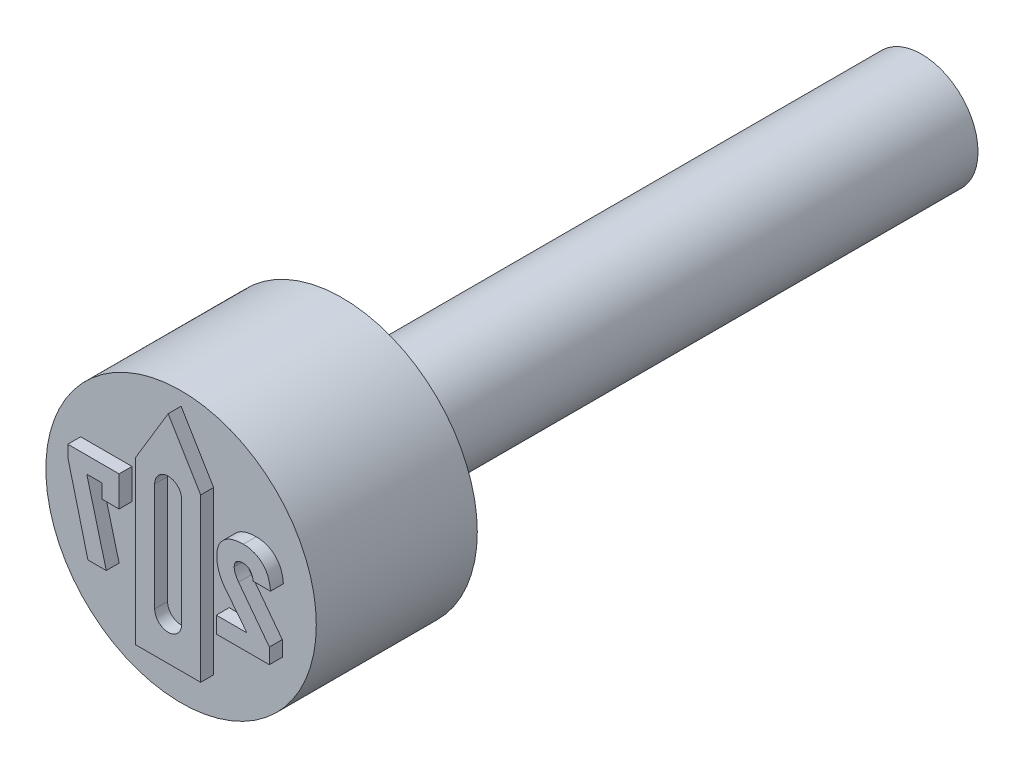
from build123d import *

# Parameters (mm, degrees)
BOSS_EXTRUDE1_DEPTH = 0.4
CUT_EXTRUDE1_DEPTH  = 0.4


with BuildPart() as part:
    # Sketch2 → Revolve1 (revolve)
    with BuildSketch(Plane(origin=(0, 0, 0), x_dir=(0, 0, -1), z_dir=(1, 0, 0)), mode=Mode.PRIVATE) as revolve1_sk:
        Polygon((0, 4.2), (0, 0), (23, 0), (23, 1.75), (5, 1.75), (5, 4.2), align=None)
    revolve(revolve1_sk.sketch.rotate(Axis((0, 0, -0.403888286), (0, 0, -1)), 90), axis=Axis((0, 0, -0.403888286), (0, 0, -1)))

    # Sketch3 → Boss-Extrude1 (add)
    with BuildSketch(Plane.XY):
        Polygon((-1.01, -2.94), (1.01, -2.94), (1.01, 2.1), (0, 3.780922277), (-1.01, 2.1), align=None)
        with BuildLine():
            Line((3.142613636, -1.4), (3.142613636, -0.923863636))
            Line((3.142613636, -0.923863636), (2.185795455, 0.34375))
            add(Edge.make_bspline(
                [(2.185795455, 0.34375), (2.165754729, 0.371988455), (2.126705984, 0.427010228), (2.091363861, 0.502571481), (2.06934718, 0.561812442), (2.058854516, 0.604773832), (2.051369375, 0.645763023), (2.050448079, 0.67269626), (2.05, 0.685795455)],
                knots=[0, 0, 0, 0, 1.664252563, 3.24274559, 3.998498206, 4.704056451, 5.369707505, 6, 6, 6, 6], degree=3))
            Line((2.05, 0.685795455), (2.05, 0.689772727))
            add(Edge.make_bspline(
                [(2.05, 0.689772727), (2.05077617, 0.707675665), (2.052263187, 0.741974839), (2.066273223, 0.790303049), (2.08923492, 0.832389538), (2.122121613, 0.867152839), (2.163063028, 0.894648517), (2.212050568, 0.914025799), (2.268443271, 0.925137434), (2.30847061, 0.92653624), (2.329545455, 0.927272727)],
                knots=[0, 0, 0, 0, 1.029992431, 1.973301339, 2.872554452, 3.768620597, 4.704316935, 5.693697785, 6.785705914, 8, 8, 8, 8], degree=3))
            add(Edge.make_bspline(
                [(2.329545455, 0.927272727), (2.350129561, 0.926469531), (2.390125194, 0.924908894), (2.446745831, 0.907612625), (2.497766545, 0.88048217), (2.541750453, 0.84177043), (2.578172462, 0.793166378), (2.607732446, 0.735931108), (2.627809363, 0.669031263), (2.634911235, 0.621141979), (2.638636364, 0.596022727)],
                knots=[0, 0, 0, 0, 0.980828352, 1.905783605, 2.800718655, 3.724477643, 4.680224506, 5.688112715, 6.78735127, 8, 8, 8, 8], degree=3))
            Line((2.638636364, 0.596022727), (2.638636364, 0.594318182))
            Line((2.638636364, 0.594318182), (3.177272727, 0.594318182))
            Line((3.177272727, 0.594318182), (3.177272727, 0.596022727))
            add(Edge.make_bspline(
                [(3.177272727, 0.596022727), (3.174614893, 0.628478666), (3.169426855, 0.691831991), (3.152418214, 0.783475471), (3.130435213, 0.86979736), (3.102469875, 0.950780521), (3.066534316, 1.02548726), (3.026159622, 1.095479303), (2.977598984, 1.15859183), (2.924442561, 1.216936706), (2.865235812, 1.268326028), (2.802105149, 1.313658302), (2.734095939, 1.351382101), (2.662242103, 1.382676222), (2.58574699, 1.406427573), (2.505609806, 1.424219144), (2.420910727, 1.434479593), (2.363095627, 1.435726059), (2.333522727, 1.436363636)],
                knots=[0, 0, 0, 0, 1.173229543, 2.290119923, 3.354877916, 4.382703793, 5.372196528, 6.339367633, 7.289741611, 8.236749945, 9.180232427, 10.11040526, 11.033485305, 11.978374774, 12.930610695, 13.916256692, 14.93414813, 16, 16, 16, 16], degree=3))
            add(Edge.make_bspline(
                [(2.333522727, 1.436363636), (2.301678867, 1.435911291), (2.239746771, 1.435031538), (2.149584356, 1.425534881), (2.064751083, 1.411201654), (1.985383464, 1.390232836), (1.911800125, 1.362880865), (1.843780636, 1.329901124), (1.781182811, 1.291012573), (1.724486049, 1.246132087), (1.673472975, 1.196075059), (1.629564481, 1.140333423), (1.591554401, 1.080033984), (1.561842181, 1.014007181), (1.537380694, 0.943805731), (1.52154226, 0.868171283), (1.510869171, 0.787994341), (1.509693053, 0.732802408), (1.509090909, 0.704545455)],
                knots=[0, 0, 0, 0, 1.219700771, 2.37215663, 3.469774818, 4.513610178, 5.512457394, 6.473141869, 7.405450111, 8.330272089, 9.238546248, 10.1372905, 11.043445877, 11.962355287, 12.905558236, 13.886315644, 14.917844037, 16, 16, 16, 16], degree=3))
            Line((1.509090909, 0.704545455), (1.509090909, 0.702272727))
            add(Edge.make_bspline(
                [(1.509090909, 0.702272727), (1.509815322, 0.670413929), (1.511265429, 0.606640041), (1.524354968, 0.511193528), (1.545448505, 0.416234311), (1.574417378, 0.322221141), (1.610404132, 0.230782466), (1.653595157, 0.143170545), (1.702341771, 0.059346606), (1.740969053, 0.007611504), (1.760227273, -0.018181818)],
                knots=[0, 0, 0, 0, 0.984368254, 1.970475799, 2.971844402, 3.988480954, 5.008197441, 6.005725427, 7.005724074, 8, 8, 8, 8], degree=3))
            Line((1.760227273, -0.018181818), (2.446590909, -0.890909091))
            Line((2.446590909, -0.890909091), (1.49375, -0.890909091))
            Line((1.49375, -0.890909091), (1.49375, -1.4))
            Line((1.49375, -1.4), (3.142613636, -1.4))
        make_face()
        Polygon((-3.117727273, 1.4), (-3.117727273, 1.048863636), (-2.492727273, -1.4), (-1.923409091, -1.4), (-2.529090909, 0.890909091), (-2.050113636, 0.890909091), (-2.050113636, 0.454545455), (-1.524545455, 0.454545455), (-1.524545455, 1.4), align=None)
    extrude(amount=BOSS_EXTRUDE1_DEPTH)

    # Sketch4 → Cut-Extrude1 (cut)
    with BuildSketch(Plane.XY.offset(0.4)):
        with BuildLine():
            Line((-0.42, 1.68), (-0.42, -1.68))
            ThreePointArc((-0.42, -1.68), (0, -2.1), (0.42, -1.68))
            Line((0.42, -1.68), (0.42, 1.68))
            ThreePointArc((0.42, 1.68), (0, 2.1), (-0.42, 1.68))
        make_face()
    extrude(amount=-CUT_EXTRUDE1_DEPTH, mode=Mode.SUBTRACT)


solid = part.part
